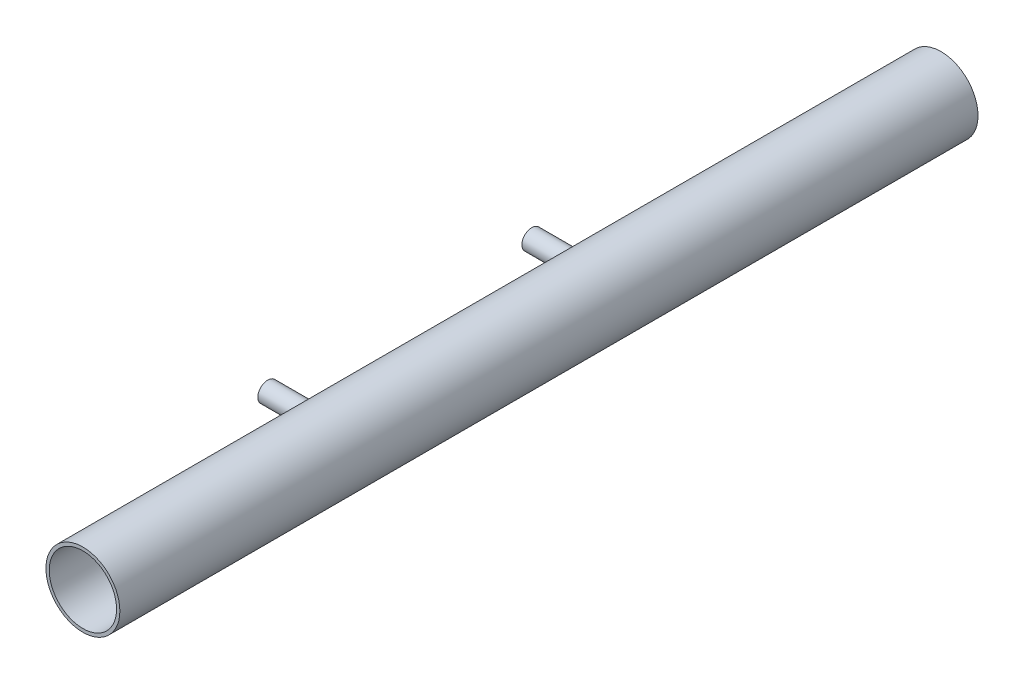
from build123d import *

# Parameters (mm, degrees)
CROQUIS1_R                 = 56
CROQUIS1_R_2               = 51
SALIENTE_EXTRUIR1_DEPTH    = 1300
CORTAR_EXTRUIR1_REACH      = 1304.41
CORTAR_EXTRUIR1_END_RADIUS = 56
CROQUIS2_R                 = 12.25
CROQUIS3_R                 = 15
CROQUIS3_R_2               = 12.25
SALIENTE_EXTRUIR2_DEPTH    = 120
CORTAR_EXTRUIR2_START      = -1000
CROQUIS4_R                 = 51
CORTAR_EXTRUIR2_DEPTH      = 1000
SALIENTE_EXTRUIR3_START    = -8
CROQUIS5_R                 = 12.25
SALIENTE_EXTRUIR3_DEPTH    = 8
CROQUIS8_R                 = 1.25
CORTAR_EXTRUIR6_DEPTH      = 10
MATRIZC1_COUNT             = 9
CROQUIS9_R                 = 1.25
CORTAR_EXTRUIR7_DEPTH      = 10
MATRIZC2_COUNT             = 9


with BuildPart() as part:
    # Croquis1 → Saliente-Extruir1 (new body)
    with BuildSketch(Plane.XY):
        Circle(CROQUIS1_R)
        Circle(CROQUIS1_R_2, mode=Mode.SUBTRACT)
    extrude(amount=SALIENTE_EXTRUIR1_DEPTH)

    # Cortar-Extruir1: up to this cylinder (the profile starts inside it)
    cortar_extruir1_end = Plane(origin=(0, 0, 700), z_dir=(0, 0, -1)) * Cylinder(CORTAR_EXTRUIR1_END_RADIUS, 3121.82, mode=Mode.PRIVATE)
    # Croquis2 → Cortar-Extruir1 (cut, up to the surface)
    with BuildSketch(Plane(origin=(0, 0, 0), x_dir=(0, 0, -1), z_dir=(1, 0, 0)), mode=Mode.PRIVATE) as cortar_extruir1_sk1:
        with Locations((-900, 0)):
            Circle(CROQUIS2_R)
    cortar_extruir1_tool1 = extrude(cortar_extruir1_sk1.sketch, amount=-CORTAR_EXTRUIR1_REACH, mode=Mode.PRIVATE) & cortar_extruir1_end
    add(cortar_extruir1_tool1.solids().sort_by_distance((0, 0, 900))[0], mode=Mode.SUBTRACT)
    # Croquis2 → Cortar-Extruir1 (cut, up to the surface)
    with BuildSketch(Plane(origin=(0, 0, 0), x_dir=(0, 0, -1), z_dir=(1, 0, 0)), mode=Mode.PRIVATE) as cortar_extruir1_sk2:
        with Locations((-500, 0)):
            Circle(CROQUIS2_R)
    cortar_extruir1_tool2 = extrude(cortar_extruir1_sk2.sketch, amount=-CORTAR_EXTRUIR1_REACH, mode=Mode.PRIVATE) & cortar_extruir1_end
    add(cortar_extruir1_tool2.solids().sort_by_distance((0, 0, 500))[0], mode=Mode.SUBTRACT)

    # Croquis3 → Saliente-Extruir2 (add)
    # profile 1 of 2: a face of its own
    with BuildSketch(Plane(origin=(0, 0, 0), x_dir=(0, 0, -1), z_dir=(1, 0, 0))):
        with Locations((-500, 0)):
            Circle(CROQUIS3_R)
        with Locations((-500, 0)):
            Circle(CROQUIS3_R_2, mode=Mode.SUBTRACT)
    # profile 2 of 2: a face of its own
    with BuildSketch(Plane(origin=(0, 0, 0), x_dir=(0, 0, -1), z_dir=(1, 0, 0))):
        with Locations((-900, 0)):
            Circle(CROQUIS3_R)
        with Locations((-900, 0)):
            Circle(CROQUIS3_R_2, mode=Mode.SUBTRACT)
    extrude(amount=-SALIENTE_EXTRUIR2_DEPTH)

    # Croquis4 → Cortar-Extruir2 (cut)
    with BuildSketch(Plane.XY.offset(1300).offset(CORTAR_EXTRUIR2_START)):
        Circle(CROQUIS4_R)
    extrude(amount=CORTAR_EXTRUIR2_DEPTH, mode=Mode.SUBTRACT)

    # Croquis5 → Saliente-Extruir3 (add)
    with BuildSketch(Plane.ZY.offset(120).offset(SALIENTE_EXTRUIR3_START)):
        with Locations(Location((900, 0, 0), (0, 0, 180))):
            Circle(CROQUIS5_R)
        with Locations(Location((500, 0, 0), (0, 0, 180))):
            Circle(CROQUIS5_R)
    extrude(amount=SALIENTE_EXTRUIR3_DEPTH)

    # Croquis8 → Cortar-Extruir6 (cut)
    with BuildSketch(Plane.ZY.offset(120)):
        with Locations((496.003196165, 0.159872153)):
            Circle(CROQUIS8_R)
        with Locations((492.016468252, 0.485449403)):
            Circle(CROQUIS8_R)
        with Locations((488.047423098, 0.982118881)):
            Circle(CROQUIS8_R)
    cortar_extruir6 = extrude(amount=-CORTAR_EXTRUIR6_DEPTH, mode=Mode.SUBTRACT)

    # MatrizC1: Cortar-Extruir6 ×9 about axis
    matrizc1_axis = Axis((0, 0, 500), (1, 0, 0))
    for i in range(1, MATRIZC1_COUNT):
        add(cortar_extruir6.rotate(matrizc1_axis, i * 360 / MATRIZC1_COUNT), mode=Mode.SUBTRACT)

    # Croquis9 → Cortar-Extruir7 (cut)
    with BuildSketch(Plane.ZY.offset(120)):
        with Locations((896.003196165, 0.159872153)):
            Circle(CROQUIS9_R)
        with Locations((892.016468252, 0.485449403)):
            Circle(CROQUIS9_R)
        with Locations((888.047423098, 0.982118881)):
            Circle(CROQUIS9_R)
    cortar_extruir7 = extrude(amount=-CORTAR_EXTRUIR7_DEPTH, mode=Mode.SUBTRACT)

    # MatrizC2: Cortar-Extruir7 ×9 about axis
    matrizc2_axis = Axis((0, 0, 900), (1, 0, 0))
    for i in range(1, MATRIZC2_COUNT):
        add(cortar_extruir7.rotate(matrizc2_axis, i * 360 / MATRIZC2_COUNT), mode=Mode.SUBTRACT)


solid = part.part
